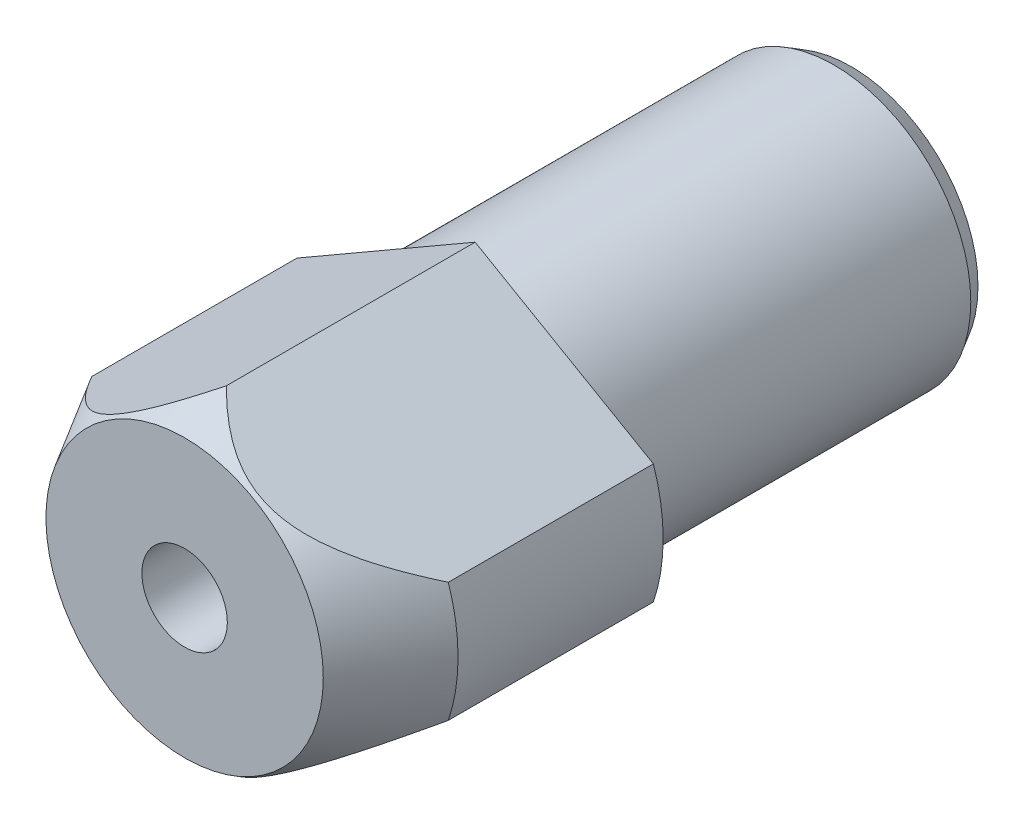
ISO-10303-21;
HEADER;
FILE_DESCRIPTION(('STEP AP214'),'2;1');
FILE_NAME('part.step','',(''),(''),'','','');
FILE_SCHEMA(('AUTOMOTIVE_DESIGN { 1 0 10303 214 1 1 1 1 }'));
ENDSEC;
DATA;
#1=APPLICATION_CONTEXT('core data for automotive mechanical design processes');
#2=APPLICATION_PROTOCOL_DEFINITION('international standard','automotive_design',2000,#1);
#3=PRODUCT_CONTEXT('',#1,'mechanical');
#4=PRODUCT('Part','Part','',(#3));
#5=PRODUCT_RELATED_PRODUCT_CATEGORY('part','',(#4));
#6=PRODUCT_DEFINITION_FORMATION('','',#4);
#7=PRODUCT_DEFINITION_CONTEXT('part definition',#1,'design');
#8=PRODUCT_DEFINITION('design','',#6,#7);
#9=PRODUCT_DEFINITION_SHAPE('','',#8);
#10=(LENGTH_UNIT() NAMED_UNIT(*) SI_UNIT(.MILLI.,.METRE.));
#11=(NAMED_UNIT(*) PLANE_ANGLE_UNIT() SI_UNIT($,.RADIAN.));
#12=(NAMED_UNIT(*) SI_UNIT($,.STERADIAN.) SOLID_ANGLE_UNIT());
#13=UNCERTAINTY_MEASURE_WITH_UNIT(LENGTH_MEASURE(1.E-05),#10,'distance_accuracy_value','');
#14=(GEOMETRIC_REPRESENTATION_CONTEXT(3) GLOBAL_UNCERTAINTY_ASSIGNED_CONTEXT((#13)) GLOBAL_UNIT_ASSIGNED_CONTEXT((#10,
#11,#12)) REPRESENTATION_CONTEXT('',''));
#15=CARTESIAN_POINT('',(0.,0.,0.));
#16=DIRECTION('',(0.,0.,1.));
#17=DIRECTION('',(1.,0.,0.));
#18=AXIS2_PLACEMENT_3D('',#15,#16,#17);
#19=CARTESIAN_POINT('',(8.,0.,0.));
#20=DIRECTION('',(0.,0.,1.));
#21=DIRECTION('',(1.,0.,0.));
#22=AXIS2_PLACEMENT_3D('',#19,#20,#21);
#23=PLANE('',#22);
#24=CARTESIAN_POINT('',(0.,0.,0.));
#25=DIRECTION('',(0.,0.,1.));
#26=DIRECTION('',(1.,0.,0.));
#27=AXIS2_PLACEMENT_3D('',#24,#25,#26);
#28=CIRCLE('',#27,8.);
#29=CARTESIAN_POINT('',(8.,0.,0.));
#30=VERTEX_POINT('',#29);
#31=EDGE_CURVE('E96',#30,#30,#28,.T.);
#32=ORIENTED_EDGE('',*,*,#31,.T.);
#33=EDGE_LOOP('',(#32));
#34=FACE_BOUND('',#33,.T.);
#35=DIRECTION('',(-0.866025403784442,0.5,0.));
#36=VECTOR('',#35,1.);
#37=CARTESIAN_POINT('',(10.4283268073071,3.5,0.));
#38=LINE('',#37,#36);
#39=CARTESIAN_POINT('',(10.4283268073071,3.5,0.));
#40=VERTEX_POINT('',#39);
#41=CARTESIAN_POINT('',(0.,9.52079728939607,0.));
#42=VERTEX_POINT('',#41);
#43=EDGE_CURVE('E79',#40,#42,#38,.T.);
#44=ORIENTED_EDGE('',*,*,#43,.F.);
#45=CARTESIAN_POINT('',(0.,0.,0.));
#46=DIRECTION('',(0.,0.,1.));
#47=DIRECTION('',(1.,0.,0.));
#48=AXIS2_PLACEMENT_3D('',#45,#46,#47);
#49=CIRCLE('',#48,11.);
#50=CARTESIAN_POINT('',(10.4283268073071,-3.5,0.));
#51=VERTEX_POINT('',#50);
#52=EDGE_CURVE('E92',#51,#40,#49,.T.);
#53=ORIENTED_EDGE('',*,*,#52,.F.);
#54=DIRECTION('',(-0.866025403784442,-0.5,0.));
#55=VECTOR('',#54,1.);
#56=CARTESIAN_POINT('',(10.4283268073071,-3.5,0.));
#57=LINE('',#56,#55);
#58=CARTESIAN_POINT('',(0.,-9.52079728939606,0.));
#59=VERTEX_POINT('',#58);
#60=EDGE_CURVE('E201',#51,#59,#57,.T.);
#61=ORIENTED_EDGE('',*,*,#60,.T.);
#62=DIRECTION('',(0.866025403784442,-0.5,0.));
#63=VECTOR('',#62,1.);
#64=CARTESIAN_POINT('',(-10.4283268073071,-3.5,0.));
#65=LINE('',#64,#63);
#66=CARTESIAN_POINT('',(-10.4283268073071,-3.5,0.));
#67=VERTEX_POINT('',#66);
#68=EDGE_CURVE('E91',#67,#59,#65,.T.);
#69=ORIENTED_EDGE('',*,*,#68,.F.);
#70=CARTESIAN_POINT('',(-10.4283268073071,3.5,0.));
#71=VERTEX_POINT('',#70);
#72=EDGE_CURVE('E85',#71,#67,#49,.T.);
#73=ORIENTED_EDGE('',*,*,#72,.F.);
#74=DIRECTION('',(0.866025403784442,0.5,0.));
#75=VECTOR('',#74,1.);
#76=CARTESIAN_POINT('',(-10.4283268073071,3.5,0.));
#77=LINE('',#76,#75);
#78=EDGE_CURVE('E71',#71,#42,#77,.T.);
#79=ORIENTED_EDGE('',*,*,#78,.T.);
#80=EDGE_LOOP('',(#44,#53,#61,#69,#73,#79));
#81=FACE_BOUND('',#80,.T.);
#82=ADVANCED_FACE('F14',(#34,#81),#23,.F.);
#83=CARTESIAN_POINT('',(0.,0.,30.));
#84=DIRECTION('',(0.,0.,1.));
#85=DIRECTION('',(1.,0.,0.));
#86=AXIS2_PLACEMENT_3D('',#83,#84,#85);
#87=CYLINDRICAL_SURFACE('',#86,11.);
#88=DIRECTION('',(0.,0.,1.));
#89=VECTOR('',#88,1.);
#90=CARTESIAN_POINT('',(10.4283268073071,3.5,0.));
#91=LINE('',#90,#89);
#92=CARTESIAN_POINT('',(10.4283268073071,3.5,12.));
#93=VERTEX_POINT('',#92);
#94=EDGE_CURVE('E197',#40,#93,#91,.T.);
#95=ORIENTED_EDGE('',*,*,#94,.T.);
#96=CARTESIAN_POINT('',(0.,0.,12.));
#97=DIRECTION('',(0.,0.,1.));
#98=DIRECTION('',(1.,0.,0.));
#99=AXIS2_PLACEMENT_3D('',#96,#97,#98);
#100=CIRCLE('',#99,11.);
#101=CARTESIAN_POINT('',(10.4283268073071,-3.5,12.));
#102=VERTEX_POINT('',#101);
#103=EDGE_CURVE('E93',#102,#93,#100,.T.);
#104=ORIENTED_EDGE('',*,*,#103,.F.);
#105=DIRECTION('',(0.,0.,1.));
#106=VECTOR('',#105,1.);
#107=CARTESIAN_POINT('',(10.4283268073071,-3.5,0.));
#108=LINE('',#107,#106);
#109=EDGE_CURVE('E209',#51,#102,#108,.T.);
#110=ORIENTED_EDGE('',*,*,#109,.F.);
#111=ORIENTED_EDGE('',*,*,#52,.T.);
#112=EDGE_LOOP('',(#95,#104,#110,#111));
#113=FACE_BOUND('',#112,.T.);
#114=ADVANCED_FACE('F150',(#113),#87,.T.);
#115=CARTESIAN_POINT('',(0.,0.,12.));
#116=DIRECTION('',(0.,0.,-1.));
#117=DIRECTION('',(-1.,0.,0.));
#118=AXIS2_PLACEMENT_3D('',#115,#116,#117);
#119=CONICAL_SURFACE('',#118,11.,0.523598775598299);
#120=CARTESIAN_POINT('',(0.,0.,17.));
#121=DIRECTION('',(0.,0.,1.));
#122=DIRECTION('',(1.,0.,0.));
#123=AXIS2_PLACEMENT_3D('',#120,#121,#122);
#124=CIRCLE('',#123,8.11324865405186);
#125=CARTESIAN_POINT('',(8.11324865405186,0.,17.));
#126=VERTEX_POINT('',#125);
#127=EDGE_CURVE('E191',#126,#126,#124,.T.);
#128=ORIENTED_EDGE('',*,*,#127,.F.);
#129=EDGE_LOOP('',(#128));
#130=FACE_BOUND('',#129,.T.);
#131=CARTESIAN_POINT('',(-0.000200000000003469,9.52091275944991,14.5618542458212));
#132=CARTESIAN_POINT('',(0.0860249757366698,9.4711307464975,14.6480735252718));
#133=CARTESIAN_POINT('',(0.173110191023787,9.42085207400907,14.7331429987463));
#134=CARTESIAN_POINT('',(0.349190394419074,9.31919212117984,14.900661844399));
#135=CARTESIAN_POINT('',(0.438185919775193,9.26781053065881,14.9831104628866));
#136=CARTESIAN_POINT('',(0.709164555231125,9.11136094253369,15.2267956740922));
#137=CARTESIAN_POINT('',(0.894264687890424,9.00449333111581,15.3834860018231));
#138=CARTESIAN_POINT('',(1.27893484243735,8.78240391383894,15.6847272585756));
#139=CARTESIAN_POINT('',(1.47875674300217,8.66703668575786,15.8288533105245));
#140=CARTESIAN_POINT('',(1.88922710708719,8.43005151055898,16.094130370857));
#141=CARTESIAN_POINT('',(2.09985028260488,8.30844816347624,16.2153321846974));
#142=CARTESIAN_POINT('',(2.43365580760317,8.11572545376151,16.3790773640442));
#143=CARTESIAN_POINT('',(2.5529293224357,8.04686285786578,16.4322911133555));
#144=CARTESIAN_POINT('',(2.79459998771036,7.90733423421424,16.5284031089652));
#145=CARTESIAN_POINT('',(2.91699736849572,7.8366680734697,16.5713005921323));
#146=CARTESIAN_POINT('',(3.16345661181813,7.69437476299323,16.6451406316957));
#147=CARTESIAN_POINT('',(3.28749766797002,7.62275962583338,16.6761750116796));
#148=CARTESIAN_POINT('',(3.53744533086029,7.47845227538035,16.7256442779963));
#149=CARTESIAN_POINT('',(3.66335156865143,7.40576027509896,16.7440816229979));
#150=CARTESIAN_POINT('',(3.91731234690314,7.25913595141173,16.7677338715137));
#151=CARTESIAN_POINT('',(4.04537592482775,7.18519841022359,16.7728210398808));
#152=CARTESIAN_POINT('',(4.3013521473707,7.03741046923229,16.7691838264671));
#153=CARTESIAN_POINT('',(4.42926479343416,6.96356006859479,16.7604595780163));
#154=CARTESIAN_POINT('',(4.68408223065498,6.81644115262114,16.7295470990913));
#155=CARTESIAN_POINT('',(4.81098482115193,6.74317390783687,16.7073349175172));
#156=CARTESIAN_POINT('',(5.06264079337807,6.59788026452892,16.650319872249));
#157=CARTESIAN_POINT('',(5.18739385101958,6.52585405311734,16.6155151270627));
#158=CARTESIAN_POINT('',(5.46940994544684,6.36303198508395,16.5229371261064));
#159=CARTESIAN_POINT('',(5.62575581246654,6.27276565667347,16.4614409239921));
#160=CARTESIAN_POINT('',(5.93307167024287,6.09533676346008,16.3225351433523));
#161=CARTESIAN_POINT('',(6.08403828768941,6.00817614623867,16.2451157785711));
#162=CARTESIAN_POINT('',(6.38165080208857,5.83634948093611,16.0764735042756));
#163=CARTESIAN_POINT('',(6.52824773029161,5.75171170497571,15.9851364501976));
#164=CARTESIAN_POINT('',(6.81591068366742,5.5856294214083,15.7916842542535));
#165=CARTESIAN_POINT('',(6.95697795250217,5.50418419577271,15.689571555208));
#166=CARTESIAN_POINT('',(7.25748890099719,5.33068411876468,15.4585691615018));
#167=CARTESIAN_POINT('',(7.41600158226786,5.2391667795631,15.3280726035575));
#168=CARTESIAN_POINT('',(7.72689739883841,5.05967099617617,15.0576449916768));
#169=CARTESIAN_POINT('',(7.87927857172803,4.97169368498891,14.917710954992));
#170=CARTESIAN_POINT('',(8.17897541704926,4.79866363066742,14.6300388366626));
#171=CARTESIAN_POINT('',(8.32627868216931,4.71361805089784,14.4822836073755));
#172=CARTESIAN_POINT('',(8.61616767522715,4.54625056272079,14.1807205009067));
#173=CARTESIAN_POINT('',(8.75875294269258,4.46392892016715,14.0269120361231));
#174=CARTESIAN_POINT('',(9.03345584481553,4.3053291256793,13.7214359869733));
#175=CARTESIAN_POINT('',(9.1657553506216,4.22894597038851,13.569985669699));
#176=CARTESIAN_POINT('',(9.42706872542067,4.07807662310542,13.2633417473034));
#177=CARTESIAN_POINT('',(9.55608239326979,4.00359054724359,13.1081479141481));
#178=CARTESIAN_POINT('',(9.81045397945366,3.85672904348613,12.7955601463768));
#179=CARTESIAN_POINT('',(9.93582909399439,3.78434368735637,12.6381848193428));
#180=CARTESIAN_POINT('',(10.1840139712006,3.64105408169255,12.3208180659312));
#181=CARTESIAN_POINT('',(10.3068242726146,3.57014952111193,12.1608272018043));
#182=CARTESIAN_POINT('',(10.4285268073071,3.49988452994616,11.9997352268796));
#183=B_SPLINE_CURVE_WITH_KNOTS('',3,(#131,#132,#133,#134,#135,#136,#137,#138,#139,#140,#141,
#142,#143,#144,#145,#146,#147,#148,#149,#150,#151,#152,#153,#154,#155,#156,#157,#158,#159,#160,
#161,#162,#163,#164,#165,#166,#167,#168,#169,#170,#171,#172,#173,#174,#175,#176,#177,#178,#179,
#180,#181,#182),.UNSPECIFIED.,.F.,.F.,(4,2,2,2,2,2,2,2,2,2,2,2,2,2,2,2,2,2,2,2,2,2,2,2,2,4),(0.,
0.395103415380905,0.790319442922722,1.5847769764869,2.40002064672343,3.21343581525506,
3.65604476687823,4.09868644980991,4.53782903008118,4.97688587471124,5.42012857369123,
5.86336699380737,6.30739480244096,6.75148898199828,7.32271656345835,7.89429627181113,
8.47084475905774,9.04726282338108,9.7212446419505,10.3954404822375,11.0711811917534,
11.7469876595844,12.3922592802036,13.0375703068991,13.679038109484,14.3203697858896),.UNSPECIFIED.);
#184=CARTESIAN_POINT('',(0.,9.52079728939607,14.5620542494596));
#185=VERTEX_POINT('',#184);
#186=EDGE_CURVE('E9',#185,#93,#183,.T.);
#187=ORIENTED_EDGE('',*,*,#186,.F.);
#188=CARTESIAN_POINT('',(0.00019999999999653,9.52091275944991,14.5618542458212));
#189=CARTESIAN_POINT('',(-0.0860249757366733,9.47113074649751,14.6480735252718));
#190=CARTESIAN_POINT('',(-0.173110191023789,9.42085207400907,14.7331429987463));
#191=CARTESIAN_POINT('',(-0.349190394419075,9.31919212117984,14.9006618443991));
#192=CARTESIAN_POINT('',(-0.438185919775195,9.26781053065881,14.9831104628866));
#193=CARTESIAN_POINT('',(-0.709164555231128,9.11136094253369,15.2267956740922));
#194=CARTESIAN_POINT('',(-0.894264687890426,9.00449333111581,15.3834860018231));
#195=CARTESIAN_POINT('',(-1.27893484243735,8.78240391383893,15.6847272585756));
#196=CARTESIAN_POINT('',(-1.47875674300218,8.66703668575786,15.8288533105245));
#197=CARTESIAN_POINT('',(-1.88922710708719,8.43005151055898,16.094130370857));
#198=CARTESIAN_POINT('',(-2.09985028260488,8.30844816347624,16.2153321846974));
#199=CARTESIAN_POINT('',(-2.43365580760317,8.11572545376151,16.3790773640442));
#200=CARTESIAN_POINT('',(-2.5529293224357,8.04686285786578,16.4322911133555));
#201=CARTESIAN_POINT('',(-2.79459998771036,7.90733423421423,16.5284031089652));
#202=CARTESIAN_POINT('',(-2.91699736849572,7.83666807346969,16.5713005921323));
#203=CARTESIAN_POINT('',(-3.16345661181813,7.69437476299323,16.6451406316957));
#204=CARTESIAN_POINT('',(-3.28749766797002,7.62275962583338,16.6761750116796));
#205=CARTESIAN_POINT('',(-3.53744533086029,7.47845227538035,16.7256442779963));
#206=CARTESIAN_POINT('',(-3.66335156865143,7.40576027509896,16.7440816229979));
#207=CARTESIAN_POINT('',(-3.91731234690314,7.25913595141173,16.7677338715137));
#208=CARTESIAN_POINT('',(-4.04537592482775,7.18519841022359,16.7728210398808));
#209=CARTESIAN_POINT('',(-4.3013521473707,7.03741046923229,16.7691838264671));
#210=CARTESIAN_POINT('',(-4.42926479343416,6.96356006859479,16.7604595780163));
#211=CARTESIAN_POINT('',(-4.68408223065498,6.81644115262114,16.7295470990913));
#212=CARTESIAN_POINT('',(-4.81098482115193,6.74317390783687,16.7073349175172));
#213=CARTESIAN_POINT('',(-5.06264079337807,6.59788026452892,16.650319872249));
#214=CARTESIAN_POINT('',(-5.18739385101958,6.52585405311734,16.6155151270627));
#215=CARTESIAN_POINT('',(-5.46940994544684,6.36303198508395,16.5229371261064));
#216=CARTESIAN_POINT('',(-5.62575581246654,6.27276565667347,16.4614409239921));
#217=CARTESIAN_POINT('',(-5.93307167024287,6.09533676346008,16.3225351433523));
#218=CARTESIAN_POINT('',(-6.08403828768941,6.00817614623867,16.2451157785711));
#219=CARTESIAN_POINT('',(-6.38165080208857,5.83634948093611,16.0764735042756));
#220=CARTESIAN_POINT('',(-6.52824773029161,5.75171170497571,15.9851364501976));
#221=CARTESIAN_POINT('',(-6.81591068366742,5.5856294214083,15.7916842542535));
#222=CARTESIAN_POINT('',(-6.95697795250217,5.50418419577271,15.689571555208));
#223=CARTESIAN_POINT('',(-7.25748890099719,5.33068411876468,15.4585691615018));
#224=CARTESIAN_POINT('',(-7.41600158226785,5.2391667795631,15.3280726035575));
#225=CARTESIAN_POINT('',(-7.7268973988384,5.05967099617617,15.0576449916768));
#226=CARTESIAN_POINT('',(-7.87927857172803,4.97169368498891,14.917710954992));
#227=CARTESIAN_POINT('',(-8.17897541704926,4.79866363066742,14.6300388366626));
#228=CARTESIAN_POINT('',(-8.32627868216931,4.71361805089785,14.4822836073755));
#229=CARTESIAN_POINT('',(-8.61616767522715,4.5462505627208,14.1807205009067));
#230=CARTESIAN_POINT('',(-8.75875294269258,4.46392892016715,14.0269120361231));
#231=CARTESIAN_POINT('',(-9.03345584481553,4.3053291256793,13.7214359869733));
#232=CARTESIAN_POINT('',(-9.1657553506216,4.22894597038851,13.569985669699));
#233=CARTESIAN_POINT('',(-9.42706872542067,4.07807662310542,13.2633417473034));
#234=CARTESIAN_POINT('',(-9.55608239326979,4.00359054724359,13.1081479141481));
#235=CARTESIAN_POINT('',(-9.81045397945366,3.85672904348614,12.7955601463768));
#236=CARTESIAN_POINT('',(-9.93582909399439,3.78434368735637,12.6381848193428));
#237=CARTESIAN_POINT('',(-10.1840139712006,3.64105408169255,12.3208180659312));
#238=CARTESIAN_POINT('',(-10.3068242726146,3.57014952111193,12.1608272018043));
#239=CARTESIAN_POINT('',(-10.4285268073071,3.49988452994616,11.9997352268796));
#240=B_SPLINE_CURVE_WITH_KNOTS('',3,(#188,#189,#190,#191,#192,#193,#194,#195,#196,#197,#198,
#199,#200,#201,#202,#203,#204,#205,#206,#207,#208,#209,#210,#211,#212,#213,#214,#215,#216,#217,
#218,#219,#220,#221,#222,#223,#224,#225,#226,#227,#228,#229,#230,#231,#232,#233,#234,#235,#236,
#237,#238,#239),.UNSPECIFIED.,.F.,.F.,(4,2,2,2,2,2,2,2,2,2,2,2,2,2,2,2,2,2,2,2,2,2,2,2,2,4),(0.,
0.395103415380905,0.790319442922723,1.5847769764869,2.40002064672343,3.21343581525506,
3.65604476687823,4.09868644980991,4.53782903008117,4.97688587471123,5.42012857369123,
5.86336699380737,6.30739480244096,6.75148898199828,7.32271656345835,7.89429627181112,
8.47084475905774,9.04726282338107,9.7212446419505,10.3954404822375,11.0711811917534,
11.7469876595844,12.3922592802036,13.0375703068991,13.679038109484,14.3203697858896),.UNSPECIFIED.);
#241=CARTESIAN_POINT('',(-10.4283268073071,3.5,12.));
#242=VERTEX_POINT('',#241);
#243=EDGE_CURVE('E28',#185,#242,#240,.T.);
#244=ORIENTED_EDGE('',*,*,#243,.T.);
#245=CARTESIAN_POINT('',(-10.4283268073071,-3.5,12.));
#246=VERTEX_POINT('',#245);
#247=EDGE_CURVE('E87',#242,#246,#100,.T.);
#248=ORIENTED_EDGE('',*,*,#247,.T.);
#249=CARTESIAN_POINT('',(0.000199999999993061,-9.5209127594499,14.5618542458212));
#250=CARTESIAN_POINT('',(-0.0860249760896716,-9.4711307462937,14.6480735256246));
#251=CARTESIAN_POINT('',(-0.173110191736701,-9.42085207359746,14.7331429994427));
#252=CARTESIAN_POINT('',(-0.349190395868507,-9.31919212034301,14.9006618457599));
#253=CARTESIAN_POINT('',(-0.438185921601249,-9.26781052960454,14.9831104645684));
#254=CARTESIAN_POINT('',(-0.70916455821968,-9.11136094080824,15.2267956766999));
#255=CARTESIAN_POINT('',(-0.894264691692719,-9.00449332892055,15.383486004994));
#256=CARTESIAN_POINT('',(-1.27893484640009,-8.78240391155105,15.6847272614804));
#257=CARTESIAN_POINT('',(-1.47875674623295,-8.66703668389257,15.8288533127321));
#258=CARTESIAN_POINT('',(-1.88922710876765,-8.43005150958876,16.0941303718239));
#259=CARTESIAN_POINT('',(-2.09985028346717,-8.30844816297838,16.2153321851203));
#260=CARTESIAN_POINT('',(-2.43365580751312,-8.11572545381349,16.379077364));
#261=CARTESIAN_POINT('',(-2.55292932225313,-8.04686285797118,16.432291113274));
#262=CARTESIAN_POINT('',(-2.79459998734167,-7.9073342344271,16.5284031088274));
#263=CARTESIAN_POINT('',(-2.91699736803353,-7.83666807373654,16.5713005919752));
#264=CARTESIAN_POINT('',(-3.16345661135,-7.69437476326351,16.6451406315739));
#265=CARTESIAN_POINT('',(-3.28749766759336,-7.62275962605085,16.6761750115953));
#266=CARTESIAN_POINT('',(-3.53744533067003,-7.4784522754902,16.7256442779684));
#267=CARTESIAN_POINT('',(-3.6633515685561,-7.40576027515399,16.744081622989));
#268=CARTESIAN_POINT('',(-3.9173123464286,-7.2591359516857,16.7677338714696));
#269=CARTESIAN_POINT('',(-4.04537592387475,-7.1851984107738,16.7728210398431));
#270=CARTESIAN_POINT('',(-4.30135214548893,-7.03741047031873,16.7691838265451));
#271=CARTESIAN_POINT('',(-4.42926479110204,-6.96356006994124,16.760459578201));
#272=CARTESIAN_POINT('',(-4.684082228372,-6.81644115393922,16.7295470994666));
#273=CARTESIAN_POINT('',(-4.81098481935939,-6.74317390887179,16.7073349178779));
#274=CARTESIAN_POINT('',(-5.06264079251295,-6.5978802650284,16.6503198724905));
#275=CARTESIAN_POINT('',(-5.18739385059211,-6.52585405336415,16.6155151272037));
#276=CARTESIAN_POINT('',(-5.46940995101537,-6.36303198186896,16.5229371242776));
#277=CARTESIAN_POINT('',(-5.62575582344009,-6.27276565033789,16.4614409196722));
#278=CARTESIAN_POINT('',(-5.93307169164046,-6.09533675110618,16.3225351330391));
#279=CARTESIAN_POINT('',(-6.08403831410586,-6.00817613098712,16.2451157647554));
#280=CARTESIAN_POINT('',(-6.38165082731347,-5.83634946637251,16.0764734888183));
#281=CARTESIAN_POINT('',(-6.5282477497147,-5.75171169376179,15.9851364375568));
#282=CARTESIAN_POINT('',(-6.81591069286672,-5.58562941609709,15.7916842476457));
#283=CARTESIAN_POINT('',(-6.95697795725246,-5.50418419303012,15.6895715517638));
#284=CARTESIAN_POINT('',(-7.25748618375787,-5.33068568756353,15.458571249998));
#285=CARTESIAN_POINT('',(-7.4159962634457,-5.2391698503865,15.3280769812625));
#286=CARTESIAN_POINT('',(-7.7268870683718,-5.05967696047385,15.0576542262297));
#287=CARTESIAN_POINT('',(-7.87926583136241,-4.97170104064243,14.9177227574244));
#288=CARTESIAN_POINT('',(-8.17895799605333,-4.79867368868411,14.6300559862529));
#289=CARTESIAN_POINT('',(-8.3262589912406,-4.71362941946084,14.4823035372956));
#290=CARTESIAN_POINT('',(-8.61614357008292,-4.5462644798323,14.1807461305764));
#291=CARTESIAN_POINT('',(-8.75872669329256,-4.46394407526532,14.026940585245));
#292=CARTESIAN_POINT('',(-9.03342564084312,-4.30534656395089,13.7214701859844));
#293=CARTESIAN_POINT('',(-9.16572332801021,-4.22896445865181,13.5700225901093));
#294=CARTESIAN_POINT('',(-9.42703313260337,-4.07809717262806,13.2633841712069));
#295=CARTESIAN_POINT('',(-9.5560450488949,-4.00361210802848,13.1081931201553));
#296=CARTESIAN_POINT('',(-9.81041322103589,-3.85675257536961,12.7956109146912));
#297=CARTESIAN_POINT('',(-9.93578667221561,-3.78436817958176,12.6382383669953));
#298=CARTESIAN_POINT('',(-10.1839682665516,-3.64108046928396,12.320877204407));
#299=CARTESIAN_POINT('',(-10.3067769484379,-3.57017684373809,12.1608891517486));
#300=CARTESIAN_POINT('',(-10.4284778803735,-3.49991277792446,11.9998));
#301=B_SPLINE_CURVE_WITH_KNOTS('',3,(#249,#250,#251,#252,#253,#254,#255,#256,#257,#258,#259,
#260,#261,#262,#263,#264,#265,#266,#267,#268,#269,#270,#271,#272,#273,#274,#275,#276,#277,#278,
#279,#280,#281,#282,#283,#284,#285,#286,#287,#288,#289,#290,#291,#292,#293,#294,#295,#296,#297,
#298,#299,#300),.UNSPECIFIED.,.F.,.F.,(4,2,2,2,2,2,2,2,2,2,2,2,2,2,2,2,2,2,2,2,2,2,2,2,2,4),(0.,
0.395103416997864,0.790319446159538,1.58477698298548,2.40002064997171,3.21343581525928,
3.65604476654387,4.09868644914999,4.53782902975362,4.97688587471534,5.42012857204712,
5.86336699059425,6.30739480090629,6.75148898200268,7.32271658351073,7.89429631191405,
8.47084477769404,9.04726282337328,9.72123333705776,10.3954178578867,11.0711471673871,
11.7469422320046,12.3922036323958,13.0375044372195,13.6789622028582,14.3202838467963),.UNSPECIFIED.);
#302=CARTESIAN_POINT('',(0.,-9.52079728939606,14.5620542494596));
#303=VERTEX_POINT('',#302);
#304=EDGE_CURVE('E115',#303,#246,#301,.T.);
#305=ORIENTED_EDGE('',*,*,#304,.F.);
#306=CARTESIAN_POINT('',(-0.000200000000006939,-9.5209127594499,14.5618542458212));
#307=CARTESIAN_POINT('',(0.0860249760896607,-9.4711307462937,14.6480735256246));
#308=CARTESIAN_POINT('',(0.173110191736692,-9.42085207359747,14.7331429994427));
#309=CARTESIAN_POINT('',(0.3491903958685,-9.31919212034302,14.9006618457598));
#310=CARTESIAN_POINT('',(0.438185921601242,-9.26781052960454,14.9831104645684));
#311=CARTESIAN_POINT('',(0.709164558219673,-9.11136094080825,15.2267956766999));
#312=CARTESIAN_POINT('',(0.894264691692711,-9.00449332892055,15.383486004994));
#313=CARTESIAN_POINT('',(1.27893484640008,-8.78240391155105,15.6847272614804));
#314=CARTESIAN_POINT('',(1.47875674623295,-8.66703668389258,15.8288533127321));
#315=CARTESIAN_POINT('',(1.88922710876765,-8.43005150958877,16.0941303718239));
#316=CARTESIAN_POINT('',(2.09985028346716,-8.30844816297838,16.2153321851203));
#317=CARTESIAN_POINT('',(2.43365580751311,-8.1157254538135,16.379077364));
#318=CARTESIAN_POINT('',(2.55292932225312,-8.04686285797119,16.432291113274));
#319=CARTESIAN_POINT('',(2.79459998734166,-7.90733423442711,16.5284031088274));
#320=CARTESIAN_POINT('',(2.91699736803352,-7.83666807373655,16.5713005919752));
#321=CARTESIAN_POINT('',(3.16345661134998,-7.69437476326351,16.6451406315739));
#322=CARTESIAN_POINT('',(3.28749766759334,-7.62275962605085,16.6761750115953));
#323=CARTESIAN_POINT('',(3.53744533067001,-7.4784522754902,16.7256442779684));
#324=CARTESIAN_POINT('',(3.66335156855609,-7.405760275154,16.744081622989));
#325=CARTESIAN_POINT('',(3.91731234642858,-7.25913595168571,16.7677338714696));
#326=CARTESIAN_POINT('',(4.04537592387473,-7.18519841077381,16.7728210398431));
#327=CARTESIAN_POINT('',(4.30135214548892,-7.03741047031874,16.7691838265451));
#328=CARTESIAN_POINT('',(4.42926479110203,-6.96356006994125,16.760459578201));
#329=CARTESIAN_POINT('',(4.68408222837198,-6.81644115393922,16.7295470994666));
#330=CARTESIAN_POINT('',(4.81098481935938,-6.7431739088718,16.7073349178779));
#331=CARTESIAN_POINT('',(5.06264079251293,-6.5978802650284,16.6503198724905));
#332=CARTESIAN_POINT('',(5.18739385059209,-6.52585405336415,16.6155151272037));
#333=CARTESIAN_POINT('',(5.46940995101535,-6.36303198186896,16.5229371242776));
#334=CARTESIAN_POINT('',(5.62575582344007,-6.27276565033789,16.4614409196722));
#335=CARTESIAN_POINT('',(5.93307169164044,-6.09533675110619,16.3225351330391));
#336=CARTESIAN_POINT('',(6.08403831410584,-6.00817613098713,16.2451157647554));
#337=CARTESIAN_POINT('',(6.38165082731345,-5.83634946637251,16.0764734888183));
#338=CARTESIAN_POINT('',(6.52824774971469,-5.75171169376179,15.9851364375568));
#339=CARTESIAN_POINT('',(6.8159106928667,-5.58562941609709,15.7916842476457));
#340=CARTESIAN_POINT('',(6.95697795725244,-5.50418419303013,15.6895715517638));
#341=CARTESIAN_POINT('',(7.25748618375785,-5.33068568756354,15.458571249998));
#342=CARTESIAN_POINT('',(7.41599626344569,-5.23916985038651,15.3280769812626));
#343=CARTESIAN_POINT('',(7.72688706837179,-5.05967696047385,15.0576542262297));
#344=CARTESIAN_POINT('',(7.8792658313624,-4.97170104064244,14.9177227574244));
#345=CARTESIAN_POINT('',(8.17895799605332,-4.79867368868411,14.6300559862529));
#346=CARTESIAN_POINT('',(8.32625899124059,-4.71362941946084,14.4823035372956));
#347=CARTESIAN_POINT('',(8.61614357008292,-4.54626447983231,14.1807461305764));
#348=CARTESIAN_POINT('',(8.75872669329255,-4.46394407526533,14.026940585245));
#349=CARTESIAN_POINT('',(9.03342564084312,-4.3053465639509,13.7214701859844));
#350=CARTESIAN_POINT('',(9.16572332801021,-4.22896445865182,13.5700225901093));
#351=CARTESIAN_POINT('',(9.42703313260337,-4.07809717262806,13.2633841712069));
#352=CARTESIAN_POINT('',(9.5560450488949,-4.00361210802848,13.1081931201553));
#353=CARTESIAN_POINT('',(9.81041322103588,-3.85675257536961,12.7956109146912));
#354=CARTESIAN_POINT('',(9.93578667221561,-3.78436817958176,12.6382383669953));
#355=CARTESIAN_POINT('',(10.1839682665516,-3.64108046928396,12.320877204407));
#356=CARTESIAN_POINT('',(10.3067769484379,-3.57017684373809,12.1608891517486));
#357=CARTESIAN_POINT('',(10.4284778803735,-3.49991277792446,11.9998));
#358=B_SPLINE_CURVE_WITH_KNOTS('',3,(#306,#307,#308,#309,#310,#311,#312,#313,#314,#315,#316,
#317,#318,#319,#320,#321,#322,#323,#324,#325,#326,#327,#328,#329,#330,#331,#332,#333,#334,#335,
#336,#337,#338,#339,#340,#341,#342,#343,#344,#345,#346,#347,#348,#349,#350,#351,#352,#353,#354,
#355,#356,#357),.UNSPECIFIED.,.F.,.F.,(4,2,2,2,2,2,2,2,2,2,2,2,2,2,2,2,2,2,2,2,2,2,2,2,2,4),(0.,
0.395103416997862,0.790319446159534,1.58477698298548,2.40002064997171,3.21343581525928,
3.65604476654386,4.09868644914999,4.53782902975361,4.97688587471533,5.42012857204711,
5.86336699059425,6.30739480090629,6.75148898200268,7.32271658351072,7.89429631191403,
8.47084477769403,9.04726282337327,9.72123333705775,10.3954178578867,11.0711471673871,
11.7469422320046,12.3922036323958,13.0375044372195,13.6789622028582,14.3202838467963),.UNSPECIFIED.);
#359=EDGE_CURVE('E122',#303,#102,#358,.T.);
#360=ORIENTED_EDGE('',*,*,#359,.T.);
#361=ORIENTED_EDGE('',*,*,#103,.T.);
#362=EDGE_LOOP('',(#187,#244,#248,#305,#360,#361));
#363=FACE_BOUND('',#362,.T.);
#364=ADVANCED_FACE('F128',(#130,#363),#119,.T.);
#365=CARTESIAN_POINT('',(0.,0.,-18.));
#366=DIRECTION('',(0.,0.,1.));
#367=DIRECTION('',(1.,0.,0.));
#368=AXIS2_PLACEMENT_3D('',#365,#366,#367);
#369=PLANE('',#368);
#370=CARTESIAN_POINT('',(0.,0.,-18.));
#371=DIRECTION('',(0.,0.,1.));
#372=DIRECTION('',(1.,0.,0.));
#373=AXIS2_PLACEMENT_3D('',#370,#371,#372);
#374=CIRCLE('',#373,1.);
#375=CARTESIAN_POINT('',(1.,0.,-18.));
#376=VERTEX_POINT('',#375);
#377=EDGE_CURVE('E112',#376,#376,#374,.T.);
#378=ORIENTED_EDGE('',*,*,#377,.F.);
#379=EDGE_LOOP('',(#378));
#380=FACE_BOUND('',#379,.T.);
#381=ADVANCED_FACE('F16',(#380),#369,.F.);
#382=CARTESIAN_POINT('',(0.,0.,30.));
#383=DIRECTION('',(0.,0.,1.));
#384=DIRECTION('',(1.,0.,0.));
#385=AXIS2_PLACEMENT_3D('',#382,#383,#384);
#386=CYLINDRICAL_SURFACE('',#385,1.);
#387=CARTESIAN_POINT('',(0.,0.,-22.));
#388=DIRECTION('',(0.,0.,1.));
#389=DIRECTION('',(1.,0.,0.));
#390=AXIS2_PLACEMENT_3D('',#387,#388,#389);
#391=CIRCLE('',#390,1.);
#392=CARTESIAN_POINT('',(1.,0.,-22.));
#393=VERTEX_POINT('',#392);
#394=EDGE_CURVE('E109',#393,#393,#391,.T.);
#395=ORIENTED_EDGE('',*,*,#394,.F.);
#396=EDGE_LOOP('',(#395));
#397=FACE_BOUND('',#396,.T.);
#398=ORIENTED_EDGE('',*,*,#377,.T.);
#399=EDGE_LOOP('',(#398));
#400=FACE_BOUND('',#399,.T.);
#401=ADVANCED_FACE('F170',(#397,#400),#386,.F.);
#402=CARTESIAN_POINT('',(1.,0.,-22.));
#403=DIRECTION('',(0.,0.,1.));
#404=DIRECTION('',(1.,0.,0.));
#405=AXIS2_PLACEMENT_3D('',#402,#403,#404);
#406=PLANE('',#405);
#407=CARTESIAN_POINT('',(0.,0.,-22.));
#408=DIRECTION('',(0.,0.,1.));
#409=DIRECTION('',(1.,0.,0.));
#410=AXIS2_PLACEMENT_3D('',#407,#408,#409);
#411=CIRCLE('',#410,7.42264973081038);
#412=CARTESIAN_POINT('',(7.42264973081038,0.,-22.));
#413=VERTEX_POINT('',#412);
#414=EDGE_CURVE('E106',#413,#413,#411,.T.);
#415=ORIENTED_EDGE('',*,*,#414,.F.);
#416=EDGE_LOOP('',(#415));
#417=FACE_BOUND('',#416,.T.);
#418=ORIENTED_EDGE('',*,*,#394,.T.);
#419=EDGE_LOOP('',(#418));
#420=FACE_BOUND('',#419,.T.);
#421=ADVANCED_FACE('F167',(#417,#420),#406,.F.);
#422=CARTESIAN_POINT('',(0.,0.,-21.));
#423=DIRECTION('',(0.,0.,1.));
#424=DIRECTION('',(1.,0.,0.));
#425=AXIS2_PLACEMENT_3D('',#422,#423,#424);
#426=CONICAL_SURFACE('',#425,8.,0.523598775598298);
#427=ORIENTED_EDGE('',*,*,#414,.T.);
#428=EDGE_LOOP('',(#427));
#429=FACE_BOUND('',#428,.T.);
#430=CARTESIAN_POINT('',(0.,0.,-21.));
#431=DIRECTION('',(0.,0.,1.));
#432=DIRECTION('',(1.,0.,0.));
#433=AXIS2_PLACEMENT_3D('',#430,#431,#432);
#434=CIRCLE('',#433,8.);
#435=CARTESIAN_POINT('',(8.,0.,-21.));
#436=VERTEX_POINT('',#435);
#437=EDGE_CURVE('E103',#436,#436,#434,.T.);
#438=ORIENTED_EDGE('',*,*,#437,.F.);
#439=EDGE_LOOP('',(#438));
#440=FACE_BOUND('',#439,.T.);
#441=ADVANCED_FACE('F163',(#429,#440),#426,.T.);
#442=CARTESIAN_POINT('',(0.,0.,30.));
#443=DIRECTION('',(0.,0.,1.));
#444=DIRECTION('',(1.,0.,0.));
#445=AXIS2_PLACEMENT_3D('',#442,#443,#444);
#446=CYLINDRICAL_SURFACE('',#445,8.);
#447=ORIENTED_EDGE('',*,*,#31,.F.);
#448=EDGE_LOOP('',(#447));
#449=FACE_BOUND('',#448,.T.);
#450=ORIENTED_EDGE('',*,*,#437,.T.);
#451=EDGE_LOOP('',(#450));
#452=FACE_BOUND('',#451,.T.);
#453=ADVANCED_FACE('F149',(#449,#452),#446,.T.);
#454=ORIENTED_EDGE('',*,*,#247,.F.);
#455=DIRECTION('',(0.,0.,1.));
#456=VECTOR('',#455,1.);
#457=CARTESIAN_POINT('',(-10.4283268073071,3.5,0.));
#458=LINE('',#457,#456);
#459=EDGE_CURVE('E35',#71,#242,#458,.T.);
#460=ORIENTED_EDGE('',*,*,#459,.F.);
#461=ORIENTED_EDGE('',*,*,#72,.T.);
#462=DIRECTION('',(0.,0.,1.));
#463=VECTOR('',#462,1.);
#464=CARTESIAN_POINT('',(-10.4283268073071,-3.5,0.));
#465=LINE('',#464,#463);
#466=EDGE_CURVE('E207',#67,#246,#465,.T.);
#467=ORIENTED_EDGE('',*,*,#466,.T.);
#468=EDGE_LOOP('',(#454,#460,#461,#467));
#469=FACE_BOUND('',#468,.T.);
#470=ADVANCED_FACE('F83',(#469),#87,.T.);
#471=CARTESIAN_POINT('',(8.11324865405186,0.,17.));
#472=DIRECTION('',(0.,0.,-1.));
#473=DIRECTION('',(-1.,0.,0.));
#474=AXIS2_PLACEMENT_3D('',#471,#472,#473);
#475=PLANE('',#474);
#476=CARTESIAN_POINT('',(0.,0.,17.));
#477=DIRECTION('',(0.,0.,1.));
#478=DIRECTION('',(1.,0.,0.));
#479=AXIS2_PLACEMENT_3D('',#476,#477,#478);
#480=CIRCLE('',#479,2.5);
#481=CARTESIAN_POINT('',(2.5,0.,17.));
#482=VERTEX_POINT('',#481);
#483=EDGE_CURVE('E211',#482,#482,#480,.T.);
#484=ORIENTED_EDGE('',*,*,#483,.F.);
#485=EDGE_LOOP('',(#484));
#486=FACE_BOUND('',#485,.T.);
#487=ORIENTED_EDGE('',*,*,#127,.T.);
#488=EDGE_LOOP('',(#487));
#489=FACE_BOUND('',#488,.T.);
#490=ADVANCED_FACE('F141',(#486,#489),#475,.F.);
#491=CARTESIAN_POINT('',(0.,0.,30.));
#492=DIRECTION('',(0.,0.,1.));
#493=DIRECTION('',(1.,0.,0.));
#494=AXIS2_PLACEMENT_3D('',#491,#492,#493);
#495=CYLINDRICAL_SURFACE('',#494,2.5);
#496=CARTESIAN_POINT('',(0.,0.,9.));
#497=DIRECTION('',(0.,0.,1.));
#498=DIRECTION('',(1.,0.,0.));
#499=AXIS2_PLACEMENT_3D('',#496,#497,#498);
#500=CIRCLE('',#499,2.5);
#501=CARTESIAN_POINT('',(2.5,0.,9.));
#502=VERTEX_POINT('',#501);
#503=EDGE_CURVE('E324',#502,#502,#500,.T.);
#504=ORIENTED_EDGE('',*,*,#503,.F.);
#505=EDGE_LOOP('',(#504));
#506=FACE_BOUND('',#505,.T.);
#507=ORIENTED_EDGE('',*,*,#483,.T.);
#508=EDGE_LOOP('',(#507));
#509=FACE_BOUND('',#508,.T.);
#510=ADVANCED_FACE('F139',(#506,#509),#495,.F.);
#511=CARTESIAN_POINT('',(10.4283268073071,-3.5,0.));
#512=DIRECTION('',(-0.5,0.866025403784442,0.));
#513=DIRECTION('',(-0.866025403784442,-0.5,0.));
#514=AXIS2_PLACEMENT_3D('',#511,#512,#513);
#515=PLANE('',#514);
#516=DIRECTION('',(0.,0.,1.));
#517=VECTOR('',#516,1.);
#518=CARTESIAN_POINT('',(0.,-9.52079728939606,0.));
#519=LINE('',#518,#517);
#520=EDGE_CURVE('E43',#59,#303,#519,.T.);
#521=ORIENTED_EDGE('',*,*,#520,.F.);
#522=ORIENTED_EDGE('',*,*,#60,.F.);
#523=ORIENTED_EDGE('',*,*,#109,.T.);
#524=ORIENTED_EDGE('',*,*,#359,.F.);
#525=EDGE_LOOP('',(#521,#522,#523,#524));
#526=FACE_BOUND('',#525,.T.);
#527=ADVANCED_FACE('F137',(#526),#515,.F.);
#528=CARTESIAN_POINT('',(-10.4283268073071,-3.5,0.));
#529=DIRECTION('',(-0.5,-0.866025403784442,0.));
#530=DIRECTION('',(0.866025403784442,-0.5,0.));
#531=AXIS2_PLACEMENT_3D('',#528,#529,#530);
#532=PLANE('',#531);
#533=ORIENTED_EDGE('',*,*,#304,.T.);
#534=ORIENTED_EDGE('',*,*,#466,.F.);
#535=ORIENTED_EDGE('',*,*,#68,.T.);
#536=ORIENTED_EDGE('',*,*,#520,.T.);
#537=EDGE_LOOP('',(#533,#534,#535,#536));
#538=FACE_BOUND('',#537,.T.);
#539=ADVANCED_FACE('F132',(#538),#532,.T.);
#540=CARTESIAN_POINT('',(10.4283268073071,3.5,0.));
#541=DIRECTION('',(0.5,0.866025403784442,0.));
#542=DIRECTION('',(-0.866025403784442,0.5,0.));
#543=AXIS2_PLACEMENT_3D('',#540,#541,#542);
#544=PLANE('',#543);
#545=ORIENTED_EDGE('',*,*,#186,.T.);
#546=ORIENTED_EDGE('',*,*,#94,.F.);
#547=ORIENTED_EDGE('',*,*,#43,.T.);
#548=DIRECTION('',(0.,0.,1.));
#549=VECTOR('',#548,1.);
#550=CARTESIAN_POINT('',(0.,9.52079728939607,0.));
#551=LINE('',#550,#549);
#552=EDGE_CURVE('E74',#42,#185,#551,.T.);
#553=ORIENTED_EDGE('',*,*,#552,.T.);
#554=EDGE_LOOP('',(#545,#546,#547,#553));
#555=FACE_BOUND('',#554,.T.);
#556=ADVANCED_FACE('F136',(#555),#544,.T.);
#557=CARTESIAN_POINT('',(-10.4283268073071,3.5,0.));
#558=DIRECTION('',(0.5,-0.866025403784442,0.));
#559=DIRECTION('',(0.866025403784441,0.5,0.));
#560=AXIS2_PLACEMENT_3D('',#557,#558,#559);
#561=PLANE('',#560);
#562=ORIENTED_EDGE('',*,*,#552,.F.);
#563=ORIENTED_EDGE('',*,*,#78,.F.);
#564=ORIENTED_EDGE('',*,*,#459,.T.);
#565=ORIENTED_EDGE('',*,*,#243,.F.);
#566=EDGE_LOOP('',(#562,#563,#564,#565));
#567=FACE_BOUND('',#566,.T.);
#568=ADVANCED_FACE('F72',(#567),#561,.F.);
#569=CARTESIAN_POINT('',(0.,0.,9.));
#570=DIRECTION('',(0.,0.,1.));
#571=DIRECTION('',(1.,0.,0.));
#572=AXIS2_PLACEMENT_3D('',#569,#570,#571);
#573=PLANE('',#572);
#574=ORIENTED_EDGE('',*,*,#503,.T.);
#575=EDGE_LOOP('',(#574));
#576=FACE_BOUND('',#575,.T.);
#577=ADVANCED_FACE('F223',(#576),#573,.T.);
#578=CLOSED_SHELL('',(#82,#114,#364,#381,#401,#421,#441,#453,#470,#490,#510,#527,#539,#556,#568,#577));
#579=MANIFOLD_SOLID_BREP('B1',#578);
#580=ADVANCED_BREP_SHAPE_REPRESENTATION('',(#18,#579),#14);
#581=SHAPE_DEFINITION_REPRESENTATION(#9,#580);
ENDSEC;
END-ISO-10303-21;
